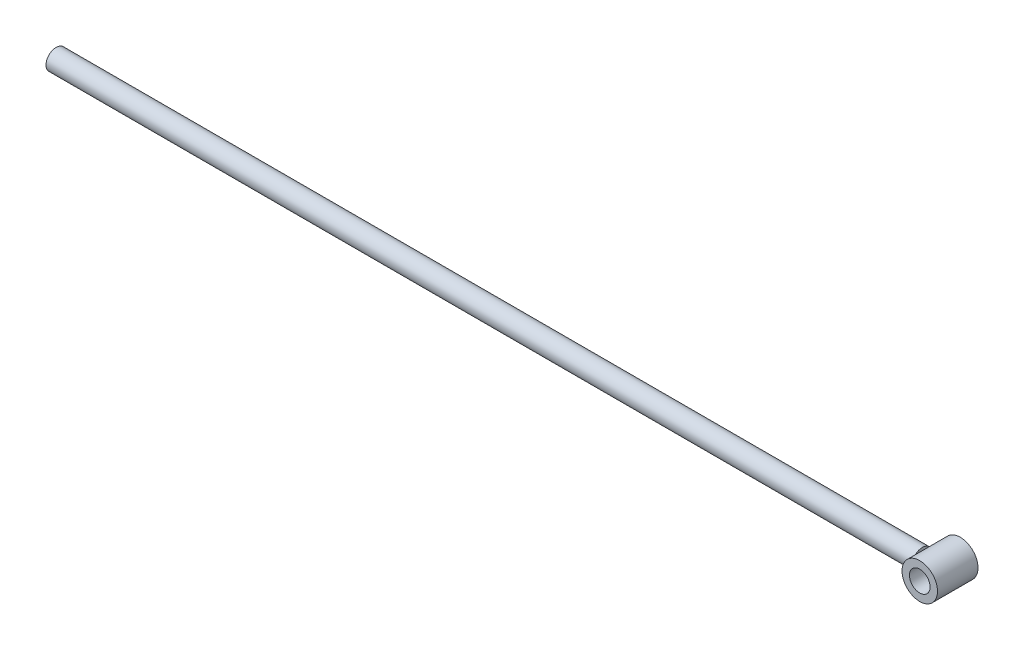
ISO-10303-21;
HEADER;
FILE_DESCRIPTION(('STEP AP214'),'2;1');
FILE_NAME('part.step','',(''),(''),'','','');
FILE_SCHEMA(('AUTOMOTIVE_DESIGN { 1 0 10303 214 1 1 1 1 }'));
ENDSEC;
DATA;
#1=APPLICATION_CONTEXT('core data for automotive mechanical design processes');
#2=APPLICATION_PROTOCOL_DEFINITION('international standard','automotive_design',2000,#1);
#3=PRODUCT_CONTEXT('',#1,'mechanical');
#4=PRODUCT('Part','Part','',(#3));
#5=PRODUCT_RELATED_PRODUCT_CATEGORY('part','',(#4));
#6=PRODUCT_DEFINITION_FORMATION('','',#4);
#7=PRODUCT_DEFINITION_CONTEXT('part definition',#1,'design');
#8=PRODUCT_DEFINITION('design','',#6,#7);
#9=PRODUCT_DEFINITION_SHAPE('','',#8);
#10=(LENGTH_UNIT() NAMED_UNIT(*) SI_UNIT(.MILLI.,.METRE.));
#11=(NAMED_UNIT(*) PLANE_ANGLE_UNIT() SI_UNIT($,.RADIAN.));
#12=(NAMED_UNIT(*) SI_UNIT($,.STERADIAN.) SOLID_ANGLE_UNIT());
#13=UNCERTAINTY_MEASURE_WITH_UNIT(LENGTH_MEASURE(1.E-05),#10,'distance_accuracy_value','');
#14=(GEOMETRIC_REPRESENTATION_CONTEXT(3) GLOBAL_UNCERTAINTY_ASSIGNED_CONTEXT((#13)) GLOBAL_UNIT_ASSIGNED_CONTEXT((#10,
#11,#12)) REPRESENTATION_CONTEXT('',''));
#15=CARTESIAN_POINT('',(0.,0.,0.));
#16=DIRECTION('',(0.,0.,1.));
#17=DIRECTION('',(1.,0.,0.));
#18=AXIS2_PLACEMENT_3D('',#15,#16,#17);
#19=CARTESIAN_POINT('',(872.5,0.,20.));
#20=DIRECTION('',(0.,0.,1.));
#21=DIRECTION('',(1.,0.,0.));
#22=AXIS2_PLACEMENT_3D('',#19,#20,#21);
#23=PLANE('',#22);
#24=CARTESIAN_POINT('',(872.5,0.,20.));
#25=DIRECTION('',(0.,0.,1.));
#26=DIRECTION('',(1.,0.,0.));
#27=AXIS2_PLACEMENT_3D('',#24,#25,#26);
#28=CIRCLE('',#27,17.4999999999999);
#29=CARTESIAN_POINT('',(890.,0.,20.));
#30=VERTEX_POINT('',#29);
#31=EDGE_CURVE('E11',#30,#30,#28,.T.);
#32=ORIENTED_EDGE('',*,*,#31,.T.);
#33=EDGE_LOOP('',(#32));
#34=FACE_BOUND('',#33,.T.);
#35=CARTESIAN_POINT('',(872.5,0.,20.));
#36=DIRECTION('',(0.,0.,1.));
#37=DIRECTION('',(1.,0.,0.));
#38=AXIS2_PLACEMENT_3D('',#35,#36,#37);
#39=CIRCLE('',#38,10.2);
#40=CARTESIAN_POINT('',(882.7,0.,20.));
#41=VERTEX_POINT('',#40);
#42=EDGE_CURVE('E48',#41,#41,#39,.T.);
#43=ORIENTED_EDGE('',*,*,#42,.F.);
#44=EDGE_LOOP('',(#43));
#45=FACE_BOUND('',#44,.T.);
#46=ADVANCED_FACE('F37',(#34,#45),#23,.T.);
#47=CARTESIAN_POINT('',(872.5,0.,-20.));
#48=DIRECTION('',(0.,0.,1.));
#49=DIRECTION('',(1.,0.,0.));
#50=AXIS2_PLACEMENT_3D('',#47,#48,#49);
#51=PLANE('',#50);
#52=CARTESIAN_POINT('',(872.5,0.,-20.));
#53=DIRECTION('',(0.,0.,1.));
#54=DIRECTION('',(1.,0.,0.));
#55=AXIS2_PLACEMENT_3D('',#52,#53,#54);
#56=CIRCLE('',#55,17.4999999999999);
#57=CARTESIAN_POINT('',(890.,0.,-20.));
#58=VERTEX_POINT('',#57);
#59=EDGE_CURVE('E44',#58,#58,#56,.T.);
#60=ORIENTED_EDGE('',*,*,#59,.F.);
#61=EDGE_LOOP('',(#60));
#62=FACE_BOUND('',#61,.T.);
#63=CARTESIAN_POINT('',(872.5,0.,-20.));
#64=DIRECTION('',(0.,0.,1.));
#65=DIRECTION('',(1.,0.,0.));
#66=AXIS2_PLACEMENT_3D('',#63,#64,#65);
#67=CIRCLE('',#66,10.2);
#68=CARTESIAN_POINT('',(882.7,0.,-20.));
#69=VERTEX_POINT('',#68);
#70=EDGE_CURVE('E52',#69,#69,#67,.T.);
#71=ORIENTED_EDGE('',*,*,#70,.T.);
#72=EDGE_LOOP('',(#71));
#73=FACE_BOUND('',#72,.T.);
#74=ADVANCED_FACE('F58',(#62,#73),#51,.F.);
#75=CARTESIAN_POINT('',(872.5,0.,20.));
#76=DIRECTION('',(0.,0.,-1.));
#77=DIRECTION('',(-1.,0.,0.));
#78=AXIS2_PLACEMENT_3D('',#75,#76,#77);
#79=CYLINDRICAL_SURFACE('',#78,17.4999999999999);
#80=ORIENTED_EDGE('',*,*,#31,.F.);
#81=EDGE_LOOP('',(#80));
#82=FACE_BOUND('',#81,.T.);
#83=ORIENTED_EDGE('',*,*,#59,.T.);
#84=EDGE_LOOP('',(#83));
#85=FACE_BOUND('',#84,.T.);
#86=ADVANCED_FACE('F39',(#82,#85),#79,.T.);
#87=CARTESIAN_POINT('',(872.5,0.,20.));
#88=DIRECTION('',(0.,0.,-1.));
#89=DIRECTION('',(-1.,0.,0.));
#90=AXIS2_PLACEMENT_3D('',#87,#88,#89);
#91=CYLINDRICAL_SURFACE('',#90,10.2);
#92=ORIENTED_EDGE('',*,*,#42,.T.);
#93=EDGE_LOOP('',(#92));
#94=FACE_BOUND('',#93,.T.);
#95=ORIENTED_EDGE('',*,*,#70,.F.);
#96=EDGE_LOOP('',(#95));
#97=FACE_BOUND('',#96,.T.);
#98=ADVANCED_FACE('F60',(#94,#97),#91,.F.);
#99=CLOSED_SHELL('',(#46,#74,#86,#98));
#100=MANIFOLD_SOLID_BREP('B2',#99);
#101=CARTESIAN_POINT('',(855.,0.,0.));
#102=DIRECTION('',(-1.,0.,0.));
#103=DIRECTION('',(0.,0.,1.));
#104=AXIS2_PLACEMENT_3D('',#101,#102,#103);
#105=CYLINDRICAL_SURFACE('',#104,10.);
#106=CARTESIAN_POINT('',(855.,0.,0.));
#107=DIRECTION('',(1.,0.,0.));
#108=DIRECTION('',(0.,0.,-1.));
#109=AXIS2_PLACEMENT_3D('',#106,#107,#108);
#110=CIRCLE('',#109,10.);
#111=CARTESIAN_POINT('',(855.,0.,10.));
#112=VERTEX_POINT('',#111);
#113=EDGE_CURVE('E36',#112,#112,#110,.T.);
#114=CARTESIAN_POINT('',(0.,0.,0.));
#115=DIRECTION('',(1.,0.,0.));
#116=DIRECTION('',(0.,0.,-1.));
#117=AXIS2_PLACEMENT_3D('',#114,#115,#116);
#118=CIRCLE('',#117,10.);
#119=CARTESIAN_POINT('',(-1.11022302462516E-13,0.,10.));
#120=VERTEX_POINT('',#119);
#121=EDGE_CURVE('E105',#120,#120,#118,.T.);
#122=CARTESIAN_POINT('',(855.,0.,10.));
#123=CARTESIAN_POINT('',(846.09375,0.,10.));
#124=CARTESIAN_POINT('',(837.1875,0.,10.));
#125=CARTESIAN_POINT('',(819.375,0.,10.));
#126=CARTESIAN_POINT('',(810.46875,0.,10.));
#127=CARTESIAN_POINT('',(792.65625,0.,10.));
#128=CARTESIAN_POINT('',(783.75,0.,10.));
#129=CARTESIAN_POINT('',(765.9375,0.,10.));
#130=CARTESIAN_POINT('',(757.03125,0.,10.));
#131=CARTESIAN_POINT('',(739.21875,0.,10.));
#132=CARTESIAN_POINT('',(730.3125,0.,10.));
#133=CARTESIAN_POINT('',(712.5,0.,10.));
#134=CARTESIAN_POINT('',(703.59375,0.,10.));
#135=CARTESIAN_POINT('',(685.78125,0.,10.));
#136=CARTESIAN_POINT('',(676.875,0.,10.));
#137=CARTESIAN_POINT('',(659.0625,0.,10.));
#138=CARTESIAN_POINT('',(650.15625,0.,10.));
#139=CARTESIAN_POINT('',(632.34375,0.,10.));
#140=CARTESIAN_POINT('',(623.4375,0.,10.));
#141=CARTESIAN_POINT('',(605.625,0.,10.));
#142=CARTESIAN_POINT('',(596.71875,0.,10.));
#143=CARTESIAN_POINT('',(578.90625,0.,10.));
#144=CARTESIAN_POINT('',(570.,0.,10.));
#145=CARTESIAN_POINT('',(552.1875,0.,10.));
#146=CARTESIAN_POINT('',(543.28125,0.,10.));
#147=CARTESIAN_POINT('',(525.46875,0.,10.));
#148=CARTESIAN_POINT('',(516.5625,0.,10.));
#149=CARTESIAN_POINT('',(498.75,0.,10.));
#150=CARTESIAN_POINT('',(489.84375,0.,10.));
#151=CARTESIAN_POINT('',(472.03125,0.,10.));
#152=CARTESIAN_POINT('',(463.125,0.,10.));
#153=CARTESIAN_POINT('',(445.3125,0.,10.));
#154=CARTESIAN_POINT('',(436.40625,0.,10.));
#155=CARTESIAN_POINT('',(418.59375,0.,10.));
#156=CARTESIAN_POINT('',(409.6875,0.,10.));
#157=CARTESIAN_POINT('',(391.875,0.,10.));
#158=CARTESIAN_POINT('',(382.96875,0.,10.));
#159=CARTESIAN_POINT('',(365.15625,0.,10.));
#160=CARTESIAN_POINT('',(356.25,0.,10.));
#161=CARTESIAN_POINT('',(338.4375,0.,10.));
#162=CARTESIAN_POINT('',(329.53125,0.,10.));
#163=CARTESIAN_POINT('',(311.71875,0.,10.));
#164=CARTESIAN_POINT('',(302.8125,0.,10.));
#165=CARTESIAN_POINT('',(285.,0.,10.));
#166=CARTESIAN_POINT('',(276.09375,0.,10.));
#167=CARTESIAN_POINT('',(258.28125,0.,10.));
#168=CARTESIAN_POINT('',(249.375,0.,10.));
#169=CARTESIAN_POINT('',(231.5625,0.,10.));
#170=CARTESIAN_POINT('',(222.65625,0.,10.));
#171=CARTESIAN_POINT('',(204.84375,0.,10.));
#172=CARTESIAN_POINT('',(195.9375,0.,10.));
#173=CARTESIAN_POINT('',(178.125,0.,10.));
#174=CARTESIAN_POINT('',(169.21875,0.,10.));
#175=CARTESIAN_POINT('',(151.40625,0.,10.));
#176=CARTESIAN_POINT('',(142.5,0.,10.));
#177=CARTESIAN_POINT('',(124.6875,0.,10.));
#178=CARTESIAN_POINT('',(115.78125,0.,10.));
#179=CARTESIAN_POINT('',(97.9687499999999,0.,10.));
#180=CARTESIAN_POINT('',(89.0624999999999,0.,10.));
#181=CARTESIAN_POINT('',(71.2499999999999,0.,10.));
#182=CARTESIAN_POINT('',(62.3437499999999,0.,10.));
#183=CARTESIAN_POINT('',(44.5312499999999,0.,10.));
#184=CARTESIAN_POINT('',(35.6249999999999,0.,10.));
#185=CARTESIAN_POINT('',(17.8124999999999,0.,10.));
#186=CARTESIAN_POINT('',(8.9062499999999,0.,10.));
#187=CARTESIAN_POINT('',(-1.11022302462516E-13,0.,10.));
#188=B_SPLINE_CURVE_WITH_KNOTS('',3,(#122,#123,#124,#125,#126,#127,#128,#129,#130,#131,#132,
#133,#134,#135,#136,#137,#138,#139,#140,#141,#142,#143,#144,#145,#146,#147,#148,#149,#150,#151,
#152,#153,#154,#155,#156,#157,#158,#159,#160,#161,#162,#163,#164,#165,#166,#167,#168,#169,#170,
#171,#172,#173,#174,#175,#176,#177,#178,#179,#180,#181,#182,#183,#184,#185,#186,#187),
.UNSPECIFIED.,.F.,.F.,(4,2,2,2,2,2,2,2,2,2,2,2,2,2,2,2,2,2,2,2,2,2,2,2,2,2,2,2,2,2,2,2,4),(0.,
26.7187499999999,53.4374999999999,80.1562499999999,106.875,133.59375,160.3125,187.03125,213.75,
240.46875,267.1875,293.90625,320.625,347.34375,374.0625,400.78125,427.5,454.21875,480.9375,
507.65625,534.375,561.09375,587.8125,614.53125,641.25,667.96875,694.6875,721.40625,748.125,
774.84375,801.5625,828.28125,855.),.UNSPECIFIED.);
#189=EDGE_CURVE('BSEAM99',#112,#120,#188,.T.);
#190=ORIENTED_EDGE('',*,*,#113,.F.);
#191=ORIENTED_EDGE('',*,*,#121,.T.);
#192=ORIENTED_EDGE('',*,*,#189,.T.);
#193=ORIENTED_EDGE('',*,*,#189,.F.);
#194=EDGE_LOOP('',(#190,#192,#191,#193));
#195=FACE_BOUND('',#194,.T.);
#196=ADVANCED_FACE('F99',(#195),#105,.T.);
#197=CARTESIAN_POINT('',(855.,0.,0.));
#198=DIRECTION('',(1.,0.,0.));
#199=DIRECTION('',(0.,0.,-1.));
#200=AXIS2_PLACEMENT_3D('',#197,#198,#199);
#201=PLANE('',#200);
#202=ORIENTED_EDGE('',*,*,#113,.T.);
#203=EDGE_LOOP('',(#202));
#204=FACE_BOUND('',#203,.T.);
#205=ADVANCED_FACE('F114',(#204),#201,.T.);
#206=CARTESIAN_POINT('',(0.,0.,0.));
#207=DIRECTION('',(1.,0.,0.));
#208=DIRECTION('',(0.,0.,-1.));
#209=AXIS2_PLACEMENT_3D('',#206,#207,#208);
#210=PLANE('',#209);
#211=ORIENTED_EDGE('',*,*,#121,.F.);
#212=EDGE_LOOP('',(#211));
#213=FACE_BOUND('',#212,.T.);
#214=ADVANCED_FACE('F112',(#213),#210,.F.);
#215=CLOSED_SHELL('',(#196,#205,#214));
#216=MANIFOLD_SOLID_BREP('B6',#215);
#217=ADVANCED_BREP_SHAPE_REPRESENTATION('',(#18,#100,#216),#14);
#218=SHAPE_DEFINITION_REPRESENTATION(#9,#217);
ENDSEC;
END-ISO-10303-21;
